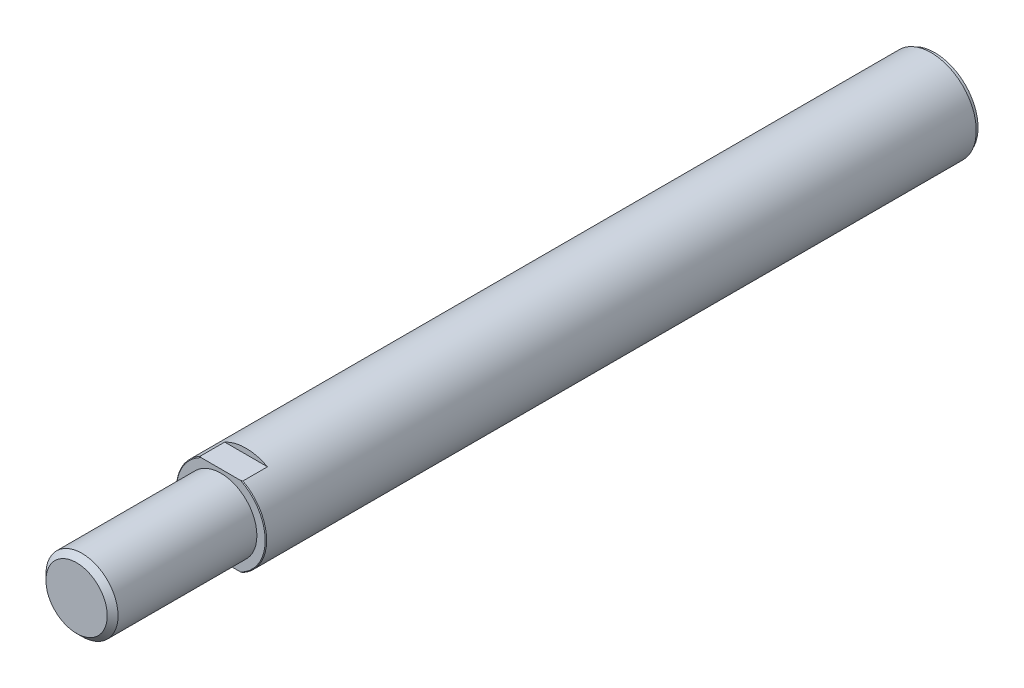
ISO-10303-21;
HEADER;
FILE_DESCRIPTION(('STEP AP214'),'2;1');
FILE_NAME('part.step','',(''),(''),'','','');
FILE_SCHEMA(('AUTOMOTIVE_DESIGN { 1 0 10303 214 1 1 1 1 }'));
ENDSEC;
DATA;
#1=APPLICATION_CONTEXT('core data for automotive mechanical design processes');
#2=APPLICATION_PROTOCOL_DEFINITION('international standard','automotive_design',2000,#1);
#3=PRODUCT_CONTEXT('',#1,'mechanical');
#4=PRODUCT('Part','Part','',(#3));
#5=PRODUCT_RELATED_PRODUCT_CATEGORY('part','',(#4));
#6=PRODUCT_DEFINITION_FORMATION('','',#4);
#7=PRODUCT_DEFINITION_CONTEXT('part definition',#1,'design');
#8=PRODUCT_DEFINITION('design','',#6,#7);
#9=PRODUCT_DEFINITION_SHAPE('','',#8);
#10=(LENGTH_UNIT() NAMED_UNIT(*) SI_UNIT(.MILLI.,.METRE.));
#11=(NAMED_UNIT(*) PLANE_ANGLE_UNIT() SI_UNIT($,.RADIAN.));
#12=(NAMED_UNIT(*) SI_UNIT($,.STERADIAN.) SOLID_ANGLE_UNIT());
#13=UNCERTAINTY_MEASURE_WITH_UNIT(LENGTH_MEASURE(1.E-05),#10,'distance_accuracy_value','');
#14=(GEOMETRIC_REPRESENTATION_CONTEXT(3) GLOBAL_UNCERTAINTY_ASSIGNED_CONTEXT((#13)) GLOBAL_UNIT_ASSIGNED_CONTEXT((#10,
#11,#12)) REPRESENTATION_CONTEXT('',''));
#15=CARTESIAN_POINT('',(0.,0.,0.));
#16=DIRECTION('',(0.,0.,1.));
#17=DIRECTION('',(1.,0.,0.));
#18=AXIS2_PLACEMENT_3D('',#15,#16,#17);
#19=CARTESIAN_POINT('',(0.,0.,238.));
#20=DIRECTION('',(0.,0.,-1.));
#21=DIRECTION('',(-1.,0.,0.));
#22=AXIS2_PLACEMENT_3D('',#19,#20,#21);
#23=CYLINDRICAL_SURFACE('',#22,12.5);
#24=DIRECTION('',(0.,0.,-1.));
#25=VECTOR('',#24,1.);
#26=CARTESIAN_POINT('',(-5.93717104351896,-11.,238.));
#27=LINE('',#26,#25);
#28=CARTESIAN_POINT('',(-5.93717104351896,-11.,197.8));
#29=VERTEX_POINT('',#28);
#30=CARTESIAN_POINT('',(-5.93717104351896,-11.,191.));
#31=VERTEX_POINT('',#30);
#32=EDGE_CURVE('E132',#29,#31,#27,.T.);
#33=ORIENTED_EDGE('',*,*,#32,.F.);
#34=CARTESIAN_POINT('',(0.,0.,197.8));
#35=DIRECTION('',(0.,0.,1.));
#36=DIRECTION('',(1.,0.,0.));
#37=AXIS2_PLACEMENT_3D('',#34,#35,#36);
#38=CIRCLE('',#37,12.5);
#39=CARTESIAN_POINT('',(-5.93717104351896,11.,197.8));
#40=VERTEX_POINT('',#39);
#41=EDGE_CURVE('E144',#29,#40,#38,.F.);
#42=ORIENTED_EDGE('',*,*,#41,.T.);
#43=DIRECTION('',(0.,0.,-1.));
#44=VECTOR('',#43,1.);
#45=CARTESIAN_POINT('',(-5.93717104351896,11.,238.));
#46=LINE('',#45,#44);
#47=CARTESIAN_POINT('',(-5.93717104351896,11.,191.));
#48=VERTEX_POINT('',#47);
#49=EDGE_CURVE('E56',#48,#40,#46,.F.);
#50=ORIENTED_EDGE('',*,*,#49,.F.);
#51=CARTESIAN_POINT('',(0.,0.,191.));
#52=DIRECTION('',(0.,0.,1.));
#53=DIRECTION('',(1.,0.,0.));
#54=AXIS2_PLACEMENT_3D('',#51,#52,#53);
#55=CIRCLE('',#54,12.5);
#56=CARTESIAN_POINT('',(5.93717104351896,11.,191.));
#57=VERTEX_POINT('',#56);
#58=EDGE_CURVE('E334',#57,#48,#55,.T.);
#59=ORIENTED_EDGE('',*,*,#58,.F.);
#60=DIRECTION('',(0.,0.,-1.));
#61=VECTOR('',#60,1.);
#62=CARTESIAN_POINT('',(5.93717104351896,11.,238.));
#63=LINE('',#62,#61);
#64=CARTESIAN_POINT('',(5.93717104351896,11.,197.8));
#65=VERTEX_POINT('',#64);
#66=EDGE_CURVE('E129',#65,#57,#63,.T.);
#67=ORIENTED_EDGE('',*,*,#66,.F.);
#68=CARTESIAN_POINT('',(5.93717104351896,-11.,197.8));
#69=VERTEX_POINT('',#68);
#70=EDGE_CURVE('E141',#65,#69,#38,.F.);
#71=ORIENTED_EDGE('',*,*,#70,.T.);
#72=DIRECTION('',(0.,0.,-1.));
#73=VECTOR('',#72,1.);
#74=CARTESIAN_POINT('',(5.93717104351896,-11.,238.));
#75=LINE('',#74,#73);
#76=CARTESIAN_POINT('',(5.93717104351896,-11.,191.));
#77=VERTEX_POINT('',#76);
#78=EDGE_CURVE('E64',#77,#69,#75,.F.);
#79=ORIENTED_EDGE('',*,*,#78,.F.);
#80=EDGE_CURVE('E337',#31,#77,#55,.T.);
#81=ORIENTED_EDGE('',*,*,#80,.F.);
#82=EDGE_LOOP('',(#33,#42,#50,#59,#67,#71,#79,#81));
#83=FACE_BOUND('',#82,.T.);
#84=CARTESIAN_POINT('',(0.,0.,1.));
#85=DIRECTION('',(0.,0.,-1.));
#86=DIRECTION('',(-1.,0.,0.));
#87=AXIS2_PLACEMENT_3D('',#84,#85,#86);
#88=CIRCLE('',#87,12.5);
#89=CARTESIAN_POINT('',(-12.5,0.,1.));
#90=VERTEX_POINT('',#89);
#91=EDGE_CURVE('E44',#90,#90,#88,.T.);
#92=ORIENTED_EDGE('',*,*,#91,.F.);
#93=EDGE_LOOP('',(#92));
#94=FACE_BOUND('',#93,.T.);
#95=ADVANCED_FACE('F40',(#83,#94),#23,.T.);
#96=CARTESIAN_POINT('',(0.,0.,198.));
#97=DIRECTION('',(0.,0.,1.));
#98=DIRECTION('',(1.,0.,0.));
#99=AXIS2_PLACEMENT_3D('',#96,#97,#98);
#100=PLANE('',#99);
#101=CARTESIAN_POINT('',(0.,0.,198.));
#102=DIRECTION('',(0.,0.,1.));
#103=DIRECTION('',(1.,0.,0.));
#104=AXIS2_PLACEMENT_3D('',#101,#102,#103);
#105=CIRCLE('',#104,10.);
#106=CARTESIAN_POINT('',(10.,0.,198.));
#107=VERTEX_POINT('',#106);
#108=EDGE_CURVE('E134',#107,#107,#105,.T.);
#109=ORIENTED_EDGE('',*,*,#108,.F.);
#110=EDGE_LOOP('',(#109));
#111=FACE_BOUND('',#110,.T.);
#112=CARTESIAN_POINT('',(0.,0.,198.));
#113=DIRECTION('',(0.,0.,1.));
#114=DIRECTION('',(1.,0.,0.));
#115=AXIS2_PLACEMENT_3D('',#112,#113,#114);
#116=CIRCLE('',#115,12.3000000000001);
#117=CARTESIAN_POINT('',(-5.50363516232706,11.,198.));
#118=VERTEX_POINT('',#117);
#119=CARTESIAN_POINT('',(-5.50363516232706,-11.,198.));
#120=VERTEX_POINT('',#119);
#121=EDGE_CURVE('E140',#118,#120,#116,.T.);
#122=ORIENTED_EDGE('',*,*,#121,.T.);
#123=DIRECTION('',(1.,0.,0.));
#124=VECTOR('',#123,1.);
#125=CARTESIAN_POINT('',(-18.9676132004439,-11.,198.));
#126=LINE('',#125,#124);
#127=CARTESIAN_POINT('',(5.50363516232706,-11.,198.));
#128=VERTEX_POINT('',#127);
#129=EDGE_CURVE('E121',#120,#128,#126,.T.);
#130=ORIENTED_EDGE('',*,*,#129,.T.);
#131=CARTESIAN_POINT('',(5.50363516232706,11.,198.));
#132=VERTEX_POINT('',#131);
#133=EDGE_CURVE('E137',#128,#132,#116,.T.);
#134=ORIENTED_EDGE('',*,*,#133,.T.);
#135=DIRECTION('',(-1.,0.,0.));
#136=VECTOR('',#135,1.);
#137=CARTESIAN_POINT('',(-18.9676132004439,11.,198.));
#138=LINE('',#137,#136);
#139=EDGE_CURVE('E123',#132,#118,#138,.T.);
#140=ORIENTED_EDGE('',*,*,#139,.T.);
#141=EDGE_LOOP('',(#122,#130,#134,#140));
#142=FACE_BOUND('',#141,.T.);
#143=ADVANCED_FACE('F181',(#111,#142),#100,.T.);
#144=CARTESIAN_POINT('',(0.,0.,198.));
#145=DIRECTION('',(0.,0.,-1.));
#146=DIRECTION('',(-1.,0.,0.));
#147=AXIS2_PLACEMENT_3D('',#144,#145,#146);
#148=CONICAL_SURFACE('',#147,12.3000000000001,0.785398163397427);
#149=ORIENTED_EDGE('',*,*,#41,.F.);
#150=CARTESIAN_POINT('',(-25.2049082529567,-11.,182.79932000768));
#151=CARTESIAN_POINT('',(-24.8332961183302,-11.,183.13989947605));
#152=CARTESIAN_POINT('',(-24.4610927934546,-11.,183.479835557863));
#153=CARTESIAN_POINT('',(-23.7153278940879,-11.,184.158220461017));
#154=CARTESIAN_POINT('',(-23.3417663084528,-11.,184.496669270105));
#155=CARTESIAN_POINT('',(-22.5930262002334,-11.,185.1719537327));
#156=CARTESIAN_POINT('',(-22.2178473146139,-11.,185.508788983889));
#157=CARTESIAN_POINT('',(-21.4657494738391,-11.,186.18051046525));
#158=CARTESIAN_POINT('',(-21.0888305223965,-11.,186.515396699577));
#159=CARTESIAN_POINT('',(-20.3305063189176,-11.,187.185120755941));
#160=CARTESIAN_POINT('',(-19.9490878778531,-11.,187.519943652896));
#161=CARTESIAN_POINT('',(-19.1839299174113,-11.,188.186926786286));
#162=CARTESIAN_POINT('',(-18.800190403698,-11.,188.519087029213));
#163=CARTESIAN_POINT('',(-18.0300668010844,-11.,189.180238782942));
#164=CARTESIAN_POINT('',(-17.6436830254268,-11.,189.509230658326));
#165=CARTESIAN_POINT('',(-16.8677829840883,-11.,190.163501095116));
#166=CARTESIAN_POINT('',(-16.4782667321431,-11.,190.488779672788));
#167=CARTESIAN_POINT('',(-15.7614675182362,-11.,191.080475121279));
#168=CARTESIAN_POINT('',(-15.4347519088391,-11.,191.347578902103));
#169=CARTESIAN_POINT('',(-14.7783997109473,-11.,191.878171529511));
#170=CARTESIAN_POINT('',(-14.448763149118,-11.,192.141660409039));
#171=CARTESIAN_POINT('',(-13.7860202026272,-11.,192.664443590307));
#172=CARTESIAN_POINT('',(-13.4529128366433,-11.,192.923736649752));
#173=CARTESIAN_POINT('',(-12.7827870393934,-11.,193.437222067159));
#174=CARTESIAN_POINT('',(-12.4457686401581,-11.,193.691414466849));
#175=CARTESIAN_POINT('',(-11.767592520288,-11.,194.193346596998));
#176=CARTESIAN_POINT('',(-11.4264404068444,-11.,194.44109388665));
#177=CARTESIAN_POINT('',(-10.7388110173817,-11.,194.929138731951));
#178=CARTESIAN_POINT('',(-10.392333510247,-11.,195.169435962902));
#179=CARTESIAN_POINT('',(-9.6933301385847,-11.,195.640735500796));
#180=CARTESIAN_POINT('',(-9.34080722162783,-11.,195.871742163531));
#181=CARTESIAN_POINT('',(-8.62854944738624,-11.,196.32231164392));
#182=CARTESIAN_POINT('',(-8.26881550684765,-11.,196.541875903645));
#183=CARTESIAN_POINT('',(-7.54622405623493,-11.,196.963558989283));
#184=CARTESIAN_POINT('',(-7.18348838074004,-11.,197.165885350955));
#185=CARTESIAN_POINT('',(-6.44862768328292,-11.,197.552951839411));
#186=CARTESIAN_POINT('',(-6.07650171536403,-11.,197.7376901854));
#187=CARTESIAN_POINT('',(-5.32234700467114,-11.,198.084623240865));
#188=CARTESIAN_POINT('',(-4.94033118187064,-11.,198.246845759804));
#189=CARTESIAN_POINT('',(-4.16548005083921,-11.,198.543160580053));
#190=CARTESIAN_POINT('',(-3.77264786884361,-11.,198.677260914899));
#191=CARTESIAN_POINT('',(-3.05749092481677,-11.,198.887010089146));
#192=CARTESIAN_POINT('',(-2.73703620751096,-11.,198.968998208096));
#193=CARTESIAN_POINT('',(-2.09063675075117,-11.,199.107537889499));
#194=CARTESIAN_POINT('',(-1.76469277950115,-11.,199.164092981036));
#195=CARTESIAN_POINT('',(-1.10994339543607,-11.,199.248894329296));
#196=CARTESIAN_POINT('',(-0.781147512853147,-11.,199.277213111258));
#197=CARTESIAN_POINT('',(-0.122326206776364,-11.,199.30424323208));
#198=CARTESIAN_POINT('',(0.207699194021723,-11.,199.302955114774));
#199=CARTESIAN_POINT('',(0.866187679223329,-11.,199.270850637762));
#200=CARTESIAN_POINT('',(1.19465120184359,-11.,199.240043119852));
#201=CARTESIAN_POINT('',(1.84773423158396,-11.,199.150587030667));
#202=CARTESIAN_POINT('',(2.17235340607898,-11.,199.09193606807));
#203=CARTESIAN_POINT('',(2.81692746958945,-11.,198.949408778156));
#204=CARTESIAN_POINT('',(3.13686596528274,-11.,198.865459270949));
#205=CARTESIAN_POINT('',(3.77013120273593,-11.,198.675776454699));
#206=CARTESIAN_POINT('',(4.08345803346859,-11.,198.570043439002));
#207=CARTESIAN_POINT('',(4.77959899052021,-11.,198.311847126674));
#208=CARTESIAN_POINT('',(5.16051287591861,-11.,198.154288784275));
#209=CARTESIAN_POINT('',(5.91217216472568,-11.,197.816371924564));
#210=CARTESIAN_POINT('',(6.28291247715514,-11.,197.636002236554));
#211=CARTESIAN_POINT('',(7.01572159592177,-11.,197.2569234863));
#212=CARTESIAN_POINT('',(7.37777248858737,-11.,197.058180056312));
#213=CARTESIAN_POINT('',(8.09354374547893,-11.,196.64643695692));
#214=CARTESIAN_POINT('',(8.44726541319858,-11.,196.433439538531));
#215=CARTESIAN_POINT('',(9.15130038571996,-11.,195.993709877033));
#216=CARTESIAN_POINT('',(9.501536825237,-11.,195.766855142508));
#217=CARTESIAN_POINT('',(10.1957742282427,-11.,195.303768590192));
#218=CARTESIAN_POINT('',(10.5397746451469,-11.,195.067535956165));
#219=CARTESIAN_POINT('',(11.2225281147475,-11.,194.587386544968));
#220=CARTESIAN_POINT('',(11.5612793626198,-11.,194.343467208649));
#221=CARTESIAN_POINT('',(12.2341678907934,-11.,193.84938373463));
#222=CARTESIAN_POINT('',(12.568305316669,-11.,193.599219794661));
#223=CARTESIAN_POINT('',(13.4491244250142,-11.,192.928993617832));
#224=CARTESIAN_POINT('',(13.9924028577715,-11.,192.504460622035));
#225=CARTESIAN_POINT('',(15.0704026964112,-11.,191.644933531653));
#226=CARTESIAN_POINT('',(15.6051257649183,-11.,191.2099415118));
#227=CARTESIAN_POINT('',(16.6682135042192,-11.,190.331532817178));
#228=CARTESIAN_POINT('',(17.1965735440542,-11.,189.888110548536));
#229=CARTESIAN_POINT('',(18.2478896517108,-11.,188.994866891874));
#230=CARTESIAN_POINT('',(18.7708454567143,-11.,188.545045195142));
#231=CARTESIAN_POINT('',(19.7911752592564,-11.,187.658678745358));
#232=CARTESIAN_POINT('',(20.288725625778,-11.,187.222336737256));
#233=CARTESIAN_POINT('',(21.2804238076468,-11.,186.345821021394));
#234=CARTESIAN_POINT('',(21.7745716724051,-11.,185.905647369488));
#235=CARTESIAN_POINT('',(22.7594616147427,-11.,185.022629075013));
#236=CARTESIAN_POINT('',(23.2502069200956,-11.,184.579788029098));
#237=CARTESIAN_POINT('',(24.2292721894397,-11.,183.691434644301));
#238=CARTESIAN_POINT('',(24.7175921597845,-11.,183.245922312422));
#239=CARTESIAN_POINT('',(25.2049082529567,-11.,182.79932000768));
#240=B_SPLINE_CURVE_WITH_KNOTS('',3,(#150,#151,#152,#153,#154,#155,#156,#157,#158,#159,#160,
#161,#162,#163,#164,#165,#166,#167,#168,#169,#170,#171,#172,#173,#174,#175,#176,#177,#178,#179,
#180,#181,#182,#183,#184,#185,#186,#187,#188,#189,#190,#191,#192,#193,#194,#195,#196,#197,#198,
#199,#200,#201,#202,#203,#204,#205,#206,#207,#208,#209,#210,#211,#212,#213,#214,#215,#216,#217,
#218,#219,#220,#221,#222,#223,#224,#225,#226,#227,#228,#229,#230,#231,#232,#233,#234,#235,#236,
#237,#238,#239),.UNSPECIFIED.,.F.,.F.,(4,2,2,2,2,2,2,2,2,2,2,2,2,2,2,2,2,2,2,2,2,2,2,2,2,2,2,2,
2,2,2,2,2,2,2,2,2,2,2,2,2,2,2,2,4),(0.,1.51222100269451,3.02445444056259,4.53704712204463,
6.0496365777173,7.5722151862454,9.09479008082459,10.61718762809,12.1395785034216,
13.4055696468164,14.671549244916,15.9378970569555,17.2042345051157,18.4690128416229,
19.7338462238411,20.9980795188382,22.2621530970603,23.5078130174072,24.7535989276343,
25.9978321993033,27.2417095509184,28.2331520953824,29.2244570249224,30.2132091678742,
31.2019431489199,32.1903810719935,33.1789039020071,34.1703140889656,35.1617109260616,
36.3973752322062,37.633647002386,38.8722798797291,40.1107176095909,41.3623951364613,
42.6141818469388,43.8663898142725,45.1185581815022,47.1867976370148,49.2546301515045,
51.3238862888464,53.3932425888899,55.3785544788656,57.3638374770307,59.3468682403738,
61.3298938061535),.UNSPECIFIED.);
#241=EDGE_CURVE('E330',#29,#120,#240,.T.);
#242=ORIENTED_EDGE('',*,*,#241,.T.);
#243=ORIENTED_EDGE('',*,*,#121,.F.);
#244=CARTESIAN_POINT('',(25.2049082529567,11.,182.79932000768));
#245=CARTESIAN_POINT('',(24.8332961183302,11.,183.13989947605));
#246=CARTESIAN_POINT('',(24.4610927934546,11.,183.479835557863));
#247=CARTESIAN_POINT('',(23.7153278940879,11.,184.158220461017));
#248=CARTESIAN_POINT('',(23.3417663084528,11.,184.496669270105));
#249=CARTESIAN_POINT('',(22.5930262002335,11.,185.1719537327));
#250=CARTESIAN_POINT('',(22.2178473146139,11.,185.508788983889));
#251=CARTESIAN_POINT('',(21.4657494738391,11.,186.18051046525));
#252=CARTESIAN_POINT('',(21.0888305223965,11.,186.515396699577));
#253=CARTESIAN_POINT('',(20.3305063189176,11.,187.185120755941));
#254=CARTESIAN_POINT('',(19.9490878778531,11.,187.519943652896));
#255=CARTESIAN_POINT('',(19.1839299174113,11.,188.186926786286));
#256=CARTESIAN_POINT('',(18.800190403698,11.,188.519087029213));
#257=CARTESIAN_POINT('',(18.0300668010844,11.,189.180238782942));
#258=CARTESIAN_POINT('',(17.6436830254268,11.,189.509230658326));
#259=CARTESIAN_POINT('',(16.8677829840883,11.,190.163501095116));
#260=CARTESIAN_POINT('',(16.4782667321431,11.,190.488779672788));
#261=CARTESIAN_POINT('',(15.7614675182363,11.,191.080475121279));
#262=CARTESIAN_POINT('',(15.4347519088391,11.,191.347578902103));
#263=CARTESIAN_POINT('',(14.7783997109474,11.,191.878171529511));
#264=CARTESIAN_POINT('',(14.448763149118,11.,192.141660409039));
#265=CARTESIAN_POINT('',(13.7860202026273,11.,192.664443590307));
#266=CARTESIAN_POINT('',(13.4529128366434,11.,192.923736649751));
#267=CARTESIAN_POINT('',(12.7827870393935,11.,193.437222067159));
#268=CARTESIAN_POINT('',(12.4457686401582,11.,193.691414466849));
#269=CARTESIAN_POINT('',(11.7675925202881,11.,194.193346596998));
#270=CARTESIAN_POINT('',(11.4264404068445,11.,194.44109388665));
#271=CARTESIAN_POINT('',(10.7388110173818,11.,194.929138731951));
#272=CARTESIAN_POINT('',(10.3923335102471,11.,195.169435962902));
#273=CARTESIAN_POINT('',(9.69333013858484,11.,195.640735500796));
#274=CARTESIAN_POINT('',(9.34080722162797,11.,195.87174216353));
#275=CARTESIAN_POINT('',(8.62854944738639,11.,196.32231164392));
#276=CARTESIAN_POINT('',(8.2688155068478,11.,196.541875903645));
#277=CARTESIAN_POINT('',(7.54622405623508,11.,196.963558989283));
#278=CARTESIAN_POINT('',(7.18348838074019,11.,197.165885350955));
#279=CARTESIAN_POINT('',(6.44862768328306,11.,197.552951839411));
#280=CARTESIAN_POINT('',(6.07650171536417,11.,197.7376901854));
#281=CARTESIAN_POINT('',(5.32234700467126,11.,198.084623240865));
#282=CARTESIAN_POINT('',(4.94033118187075,11.,198.246845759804));
#283=CARTESIAN_POINT('',(4.16548005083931,11.,198.543160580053));
#284=CARTESIAN_POINT('',(3.77264786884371,11.,198.677260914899));
#285=CARTESIAN_POINT('',(3.05749092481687,11.,198.887010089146));
#286=CARTESIAN_POINT('',(2.73703620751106,11.,198.968998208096));
#287=CARTESIAN_POINT('',(2.09063675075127,11.,199.107537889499));
#288=CARTESIAN_POINT('',(1.76469277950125,11.,199.164092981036));
#289=CARTESIAN_POINT('',(1.10994339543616,11.,199.248894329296));
#290=CARTESIAN_POINT('',(0.781147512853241,11.,199.277213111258));
#291=CARTESIAN_POINT('',(0.122326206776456,11.,199.30424323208));
#292=CARTESIAN_POINT('',(-0.207699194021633,11.,199.302955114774));
#293=CARTESIAN_POINT('',(-0.866187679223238,11.,199.270850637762));
#294=CARTESIAN_POINT('',(-1.1946512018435,11.,199.240043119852));
#295=CARTESIAN_POINT('',(-1.84773423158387,11.,199.150587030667));
#296=CARTESIAN_POINT('',(-2.17235340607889,11.,199.09193606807));
#297=CARTESIAN_POINT('',(-2.81692746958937,11.,198.949408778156));
#298=CARTESIAN_POINT('',(-3.13686596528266,11.,198.865459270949));
#299=CARTESIAN_POINT('',(-3.77013120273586,11.,198.6757764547));
#300=CARTESIAN_POINT('',(-4.08345803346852,11.,198.570043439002));
#301=CARTESIAN_POINT('',(-4.77959899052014,11.,198.311847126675));
#302=CARTESIAN_POINT('',(-5.16051287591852,11.,198.154288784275));
#303=CARTESIAN_POINT('',(-5.91217216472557,11.,197.816371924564));
#304=CARTESIAN_POINT('',(-6.28291247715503,11.,197.636002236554));
#305=CARTESIAN_POINT('',(-7.01572159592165,11.,197.2569234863));
#306=CARTESIAN_POINT('',(-7.37777248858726,11.,197.058180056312));
#307=CARTESIAN_POINT('',(-8.0935437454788,11.,196.64643695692));
#308=CARTESIAN_POINT('',(-8.44726541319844,11.,196.433439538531));
#309=CARTESIAN_POINT('',(-9.15130038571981,11.,195.993709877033));
#310=CARTESIAN_POINT('',(-9.50153682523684,11.,195.766855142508));
#311=CARTESIAN_POINT('',(-10.1957742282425,11.,195.303768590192));
#312=CARTESIAN_POINT('',(-10.5397746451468,11.,195.067535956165));
#313=CARTESIAN_POINT('',(-11.2225281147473,11.,194.587386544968));
#314=CARTESIAN_POINT('',(-11.5612793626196,11.,194.343467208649));
#315=CARTESIAN_POINT('',(-12.2341678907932,11.,193.849383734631));
#316=CARTESIAN_POINT('',(-12.5683053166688,11.,193.599219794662));
#317=CARTESIAN_POINT('',(-13.4491244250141,11.,192.928993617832));
#318=CARTESIAN_POINT('',(-13.9924028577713,11.,192.504460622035));
#319=CARTESIAN_POINT('',(-15.0704026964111,11.,191.644933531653));
#320=CARTESIAN_POINT('',(-15.6051257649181,11.,191.2099415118));
#321=CARTESIAN_POINT('',(-16.6682135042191,11.,190.331532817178));
#322=CARTESIAN_POINT('',(-17.1965735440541,11.,189.888110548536));
#323=CARTESIAN_POINT('',(-18.2478896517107,11.,188.994866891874));
#324=CARTESIAN_POINT('',(-18.7708454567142,11.,188.545045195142));
#325=CARTESIAN_POINT('',(-19.7911752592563,11.,187.658678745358));
#326=CARTESIAN_POINT('',(-20.2887256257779,11.,187.222336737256));
#327=CARTESIAN_POINT('',(-21.2804238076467,11.,186.345821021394));
#328=CARTESIAN_POINT('',(-21.774571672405,11.,185.905647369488));
#329=CARTESIAN_POINT('',(-22.7594616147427,11.,185.022629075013));
#330=CARTESIAN_POINT('',(-23.2502069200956,11.,184.579788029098));
#331=CARTESIAN_POINT('',(-24.2292721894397,11.,183.691434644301));
#332=CARTESIAN_POINT('',(-24.7175921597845,11.,183.245922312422));
#333=CARTESIAN_POINT('',(-25.2049082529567,11.,182.79932000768));
#334=B_SPLINE_CURVE_WITH_KNOTS('',3,(#244,#245,#246,#247,#248,#249,#250,#251,#252,#253,#254,
#255,#256,#257,#258,#259,#260,#261,#262,#263,#264,#265,#266,#267,#268,#269,#270,#271,#272,#273,
#274,#275,#276,#277,#278,#279,#280,#281,#282,#283,#284,#285,#286,#287,#288,#289,#290,#291,#292,
#293,#294,#295,#296,#297,#298,#299,#300,#301,#302,#303,#304,#305,#306,#307,#308,#309,#310,#311,
#312,#313,#314,#315,#316,#317,#318,#319,#320,#321,#322,#323,#324,#325,#326,#327,#328,#329,#330,
#331,#332,#333),.UNSPECIFIED.,.F.,.F.,(4,2,2,2,2,2,2,2,2,2,2,2,2,2,2,2,2,2,2,2,2,2,2,2,2,2,2,2,
2,2,2,2,2,2,2,2,2,2,2,2,2,2,2,2,4),(0.,1.51222100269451,3.02445444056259,4.53704712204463,
6.04963657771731,7.57221518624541,9.09479008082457,10.61718762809,12.1395785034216,
13.4055696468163,14.6715492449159,15.9378970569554,17.2042345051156,18.4690128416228,
19.7338462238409,20.998079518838,22.2621530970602,23.507813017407,24.7535989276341,
25.9978321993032,27.2417095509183,28.2331520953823,29.2244570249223,30.2132091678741,
31.2019431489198,32.1903810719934,33.178903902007,34.1703140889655,35.1617109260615,
36.3973752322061,37.6336470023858,38.872279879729,40.1107176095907,41.3623951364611,
42.6141818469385,43.8663898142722,45.1185581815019,47.1867976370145,49.2546301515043,
51.3238862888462,53.3932425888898,55.3785544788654,57.3638374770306,59.3468682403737,
61.3298938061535),.UNSPECIFIED.);
#335=EDGE_CURVE('E145',#118,#40,#334,.T.);
#336=ORIENTED_EDGE('',*,*,#335,.T.);
#337=EDGE_LOOP('',(#149,#242,#243,#336));
#338=FACE_BOUND('',#337,.T.);
#339=ADVANCED_FACE('F160',(#338),#148,.T.);
#340=ORIENTED_EDGE('',*,*,#133,.F.);
#341=EDGE_CURVE('E153',#128,#69,#240,.T.);
#342=ORIENTED_EDGE('',*,*,#341,.T.);
#343=ORIENTED_EDGE('',*,*,#70,.F.);
#344=EDGE_CURVE('E152',#65,#132,#334,.T.);
#345=ORIENTED_EDGE('',*,*,#344,.T.);
#346=EDGE_LOOP('',(#340,#342,#343,#345));
#347=FACE_BOUND('',#346,.T.);
#348=ADVANCED_FACE('F179',(#347),#148,.T.);
#349=CARTESIAN_POINT('',(0.,0.,198.));
#350=DIRECTION('',(0.,0.,1.));
#351=DIRECTION('',(1.,0.,0.));
#352=AXIS2_PLACEMENT_3D('',#349,#350,#351);
#353=CYLINDRICAL_SURFACE('',#352,10.);
#354=CARTESIAN_POINT('',(0.,0.,236.5));
#355=DIRECTION('',(0.,0.,1.));
#356=DIRECTION('',(1.,0.,0.));
#357=AXIS2_PLACEMENT_3D('',#354,#355,#356);
#358=CIRCLE('',#357,10.);
#359=CARTESIAN_POINT('',(10.,0.,236.5));
#360=VERTEX_POINT('',#359);
#361=EDGE_CURVE('E12',#360,#360,#358,.F.);
#362=ORIENTED_EDGE('',*,*,#361,.T.);
#363=EDGE_LOOP('',(#362));
#364=FACE_BOUND('',#363,.T.);
#365=ORIENTED_EDGE('',*,*,#108,.T.);
#366=EDGE_LOOP('',(#365));
#367=FACE_BOUND('',#366,.T.);
#368=ADVANCED_FACE('F176',(#364,#367),#353,.T.);
#369=CARTESIAN_POINT('',(0.,0.,238.));
#370=DIRECTION('',(0.,0.,1.));
#371=DIRECTION('',(1.,0.,0.));
#372=AXIS2_PLACEMENT_3D('',#369,#370,#371);
#373=PLANE('',#372);
#374=CARTESIAN_POINT('',(0.,0.,238.));
#375=DIRECTION('',(0.,0.,1.));
#376=DIRECTION('',(1.,0.,0.));
#377=AXIS2_PLACEMENT_3D('',#374,#375,#376);
#378=CIRCLE('',#377,8.49999999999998);
#379=CARTESIAN_POINT('',(8.49999999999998,0.,238.));
#380=VERTEX_POINT('',#379);
#381=EDGE_CURVE('E49',#380,#380,#378,.T.);
#382=ORIENTED_EDGE('',*,*,#381,.T.);
#383=EDGE_LOOP('',(#382));
#384=FACE_BOUND('',#383,.T.);
#385=ADVANCED_FACE('F168',(#384),#373,.T.);
#386=CARTESIAN_POINT('',(-18.9676132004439,11.,191.));
#387=DIRECTION('',(0.,1.,0.));
#388=DIRECTION('',(0.,0.,1.));
#389=AXIS2_PLACEMENT_3D('',#386,#387,#388);
#390=PLANE('',#389);
#391=ORIENTED_EDGE('',*,*,#66,.T.);
#392=DIRECTION('',(-1.,0.,0.));
#393=VECTOR('',#392,1.);
#394=CARTESIAN_POINT('',(-18.9676132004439,11.,191.));
#395=LINE('',#394,#393);
#396=EDGE_CURVE('E118',#57,#48,#395,.T.);
#397=ORIENTED_EDGE('',*,*,#396,.T.);
#398=ORIENTED_EDGE('',*,*,#49,.T.);
#399=ORIENTED_EDGE('',*,*,#335,.F.);
#400=ORIENTED_EDGE('',*,*,#139,.F.);
#401=ORIENTED_EDGE('',*,*,#344,.F.);
#402=EDGE_LOOP('',(#391,#397,#398,#399,#400,#401));
#403=FACE_BOUND('',#402,.T.);
#404=ADVANCED_FACE('F163',(#403),#390,.T.);
#405=CARTESIAN_POINT('',(0.,0.,191.));
#406=DIRECTION('',(0.,0.,1.));
#407=DIRECTION('',(1.,0.,0.));
#408=AXIS2_PLACEMENT_3D('',#405,#406,#407);
#409=PLANE('',#408);
#410=ORIENTED_EDGE('',*,*,#58,.T.);
#411=ORIENTED_EDGE('',*,*,#396,.F.);
#412=EDGE_LOOP('',(#410,#411));
#413=FACE_BOUND('',#412,.T.);
#414=ADVANCED_FACE('F167',(#413),#409,.T.);
#415=ORIENTED_EDGE('',*,*,#80,.T.);
#416=DIRECTION('',(1.,0.,0.));
#417=VECTOR('',#416,1.);
#418=CARTESIAN_POINT('',(-18.9676132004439,-11.,191.));
#419=LINE('',#418,#417);
#420=EDGE_CURVE('E120',#31,#77,#419,.T.);
#421=ORIENTED_EDGE('',*,*,#420,.F.);
#422=EDGE_LOOP('',(#415,#421));
#423=FACE_BOUND('',#422,.T.);
#424=ADVANCED_FACE('F174',(#423),#409,.T.);
#425=CARTESIAN_POINT('',(-18.9676132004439,-11.,191.));
#426=DIRECTION('',(0.,-1.,0.));
#427=DIRECTION('',(0.,0.,-1.));
#428=AXIS2_PLACEMENT_3D('',#425,#426,#427);
#429=PLANE('',#428);
#430=ORIENTED_EDGE('',*,*,#32,.T.);
#431=ORIENTED_EDGE('',*,*,#420,.T.);
#432=ORIENTED_EDGE('',*,*,#78,.T.);
#433=ORIENTED_EDGE('',*,*,#341,.F.);
#434=ORIENTED_EDGE('',*,*,#129,.F.);
#435=ORIENTED_EDGE('',*,*,#241,.F.);
#436=EDGE_LOOP('',(#430,#431,#432,#433,#434,#435));
#437=FACE_BOUND('',#436,.T.);
#438=ADVANCED_FACE('F169',(#437),#429,.T.);
#439=CARTESIAN_POINT('',(0.,0.,238.));
#440=DIRECTION('',(0.,0.,-1.));
#441=DIRECTION('',(-1.,0.,0.));
#442=AXIS2_PLACEMENT_3D('',#439,#440,#441);
#443=CONICAL_SURFACE('',#442,8.49999999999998,0.785398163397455);
#444=ORIENTED_EDGE('',*,*,#361,.F.);
#445=EDGE_LOOP('',(#444));
#446=FACE_BOUND('',#445,.T.);
#447=ORIENTED_EDGE('',*,*,#381,.F.);
#448=EDGE_LOOP('',(#447));
#449=FACE_BOUND('',#448,.T.);
#450=ADVANCED_FACE('F42',(#446,#449),#443,.T.);
#451=CARTESIAN_POINT('',(0.,0.,1.));
#452=DIRECTION('',(0.,0.,-1.));
#453=DIRECTION('',(-1.,0.,0.));
#454=AXIS2_PLACEMENT_3D('',#451,#452,#453);
#455=PLANE('',#454);
#456=CARTESIAN_POINT('',(0.,0.,1.));
#457=DIRECTION('',(0.,0.,-1.));
#458=DIRECTION('',(-1.,0.,0.));
#459=AXIS2_PLACEMENT_3D('',#456,#457,#458);
#460=CIRCLE('',#459,12.);
#461=CARTESIAN_POINT('',(-12.,0.,1.));
#462=VERTEX_POINT('',#461);
#463=EDGE_CURVE('E111',#462,#462,#460,.T.);
#464=ORIENTED_EDGE('',*,*,#463,.F.);
#465=EDGE_LOOP('',(#464));
#466=FACE_BOUND('',#465,.T.);
#467=ORIENTED_EDGE('',*,*,#91,.T.);
#468=EDGE_LOOP('',(#467));
#469=FACE_BOUND('',#468,.T.);
#470=ADVANCED_FACE('F203',(#466,#469),#455,.T.);
#471=CARTESIAN_POINT('',(0.,0.,1.));
#472=DIRECTION('',(0.,0.,-1.));
#473=DIRECTION('',(-1.,0.,0.));
#474=AXIS2_PLACEMENT_3D('',#471,#472,#473);
#475=CYLINDRICAL_SURFACE('',#474,12.);
#476=ORIENTED_EDGE('',*,*,#463,.T.);
#477=EDGE_LOOP('',(#476));
#478=FACE_BOUND('',#477,.T.);
#479=CARTESIAN_POINT('',(0.,0.,0.));
#480=DIRECTION('',(0.,0.,-1.));
#481=DIRECTION('',(-1.,0.,0.));
#482=AXIS2_PLACEMENT_3D('',#479,#480,#481);
#483=CIRCLE('',#482,12.);
#484=CARTESIAN_POINT('',(-12.,0.,0.));
#485=VERTEX_POINT('',#484);
#486=EDGE_CURVE('E107',#485,#485,#483,.T.);
#487=ORIENTED_EDGE('',*,*,#486,.F.);
#488=EDGE_LOOP('',(#487));
#489=FACE_BOUND('',#488,.T.);
#490=ADVANCED_FACE('F189',(#478,#489),#475,.T.);
#491=CARTESIAN_POINT('',(0.,0.,0.));
#492=DIRECTION('',(0.,0.,1.));
#493=DIRECTION('',(1.,0.,0.));
#494=AXIS2_PLACEMENT_3D('',#491,#492,#493);
#495=PLANE('',#494);
#496=CARTESIAN_POINT('',(0.,0.,0.));
#497=DIRECTION('',(0.,0.,-1.));
#498=DIRECTION('',(-1.,0.,0.));
#499=AXIS2_PLACEMENT_3D('',#496,#497,#498);
#500=CIRCLE('',#499,5.1);
#501=CARTESIAN_POINT('',(-5.1,0.,0.));
#502=VERTEX_POINT('',#501);
#503=EDGE_CURVE('E108',#502,#502,#500,.T.);
#504=ORIENTED_EDGE('',*,*,#503,.F.);
#505=EDGE_LOOP('',(#504));
#506=FACE_BOUND('',#505,.T.);
#507=ORIENTED_EDGE('',*,*,#486,.T.);
#508=EDGE_LOOP('',(#507));
#509=FACE_BOUND('',#508,.T.);
#510=ADVANCED_FACE('F101',(#506,#509),#495,.F.);
#511=CARTESIAN_POINT('',(0.,0.,32.75));
#512=DIRECTION('',(0.,0.,-1.));
#513=DIRECTION('',(-1.,0.,0.));
#514=AXIS2_PLACEMENT_3D('',#511,#512,#513);
#515=CONICAL_SURFACE('',#514,5.09999999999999,1.02974425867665);
#516=CARTESIAN_POINT('',(0.,0.,35.8143891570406));
#517=VERTEX_POINT('',#516);
#518=VERTEX_LOOP('',#517);
#519=FACE_BOUND('',#518,.T.);
#520=CARTESIAN_POINT('',(0.,0.,32.75));
#521=DIRECTION('',(0.,0.,-1.));
#522=DIRECTION('',(-1.,0.,0.));
#523=AXIS2_PLACEMENT_3D('',#520,#521,#522);
#524=CIRCLE('',#523,5.09999999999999);
#525=CARTESIAN_POINT('',(-5.09999999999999,0.,32.75));
#526=VERTEX_POINT('',#525);
#527=EDGE_CURVE('E105',#526,#526,#524,.T.);
#528=ORIENTED_EDGE('',*,*,#527,.T.);
#529=EDGE_LOOP('',(#528));
#530=FACE_BOUND('',#529,.T.);
#531=ADVANCED_FACE('F97',(#519,#530),#515,.F.);
#532=CARTESIAN_POINT('',(0.,0.,0.));
#533=DIRECTION('',(0.,0.,-1.));
#534=DIRECTION('',(-1.,0.,0.));
#535=AXIS2_PLACEMENT_3D('',#532,#533,#534);
#536=CYLINDRICAL_SURFACE('',#535,5.09999999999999);
#537=ORIENTED_EDGE('',*,*,#527,.F.);
#538=EDGE_LOOP('',(#537));
#539=FACE_BOUND('',#538,.T.);
#540=ORIENTED_EDGE('',*,*,#503,.T.);
#541=EDGE_LOOP('',(#540));
#542=FACE_BOUND('',#541,.T.);
#543=ADVANCED_FACE('F100',(#539,#542),#536,.F.);
#544=CLOSED_SHELL('',(#95,#143,#339,#348,#368,#385,#404,#414,#424,#438,#450,#470,#490,#510,#531,#543));
#545=MANIFOLD_SOLID_BREP('B2',#544);
#546=ADVANCED_BREP_SHAPE_REPRESENTATION('',(#18,#545),#14);
#547=SHAPE_DEFINITION_REPRESENTATION(#9,#546);
ENDSEC;
END-ISO-10303-21;
